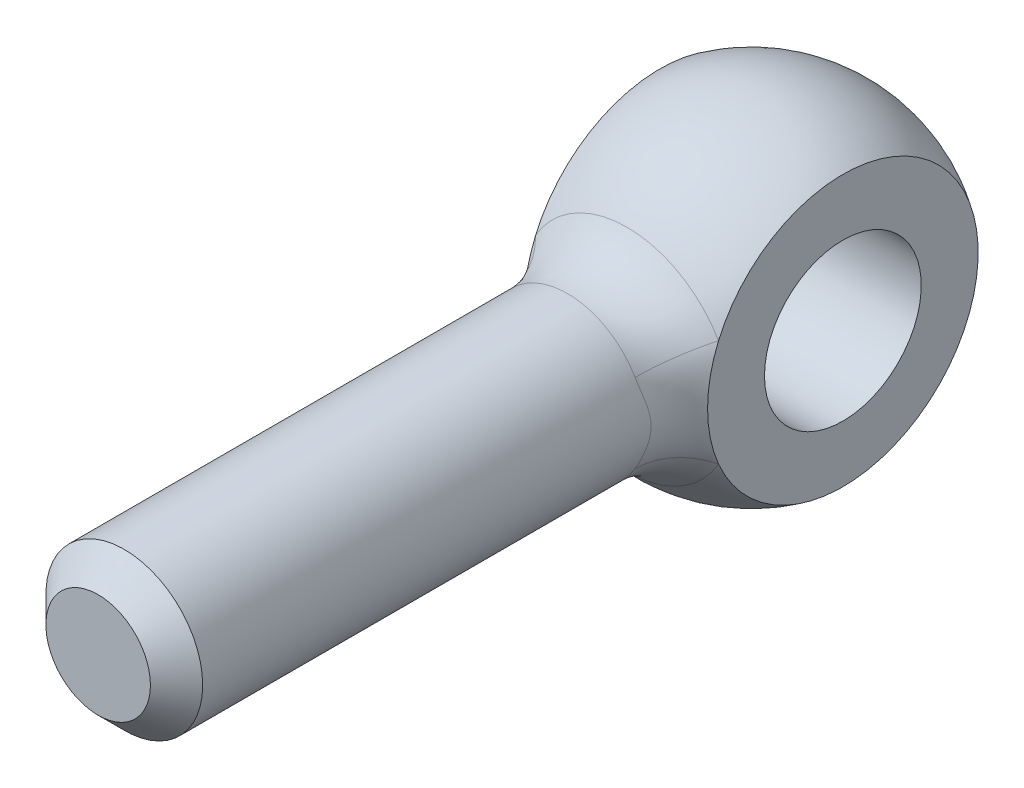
ISO-10303-21;
HEADER;
FILE_DESCRIPTION(('STEP AP214'),'2;1');
FILE_NAME('part.step','',(''),(''),'','','');
FILE_SCHEMA(('AUTOMOTIVE_DESIGN { 1 0 10303 214 1 1 1 1 }'));
ENDSEC;
DATA;
#1=APPLICATION_CONTEXT('core data for automotive mechanical design processes');
#2=APPLICATION_PROTOCOL_DEFINITION('international standard','automotive_design',2000,#1);
#3=PRODUCT_CONTEXT('',#1,'mechanical');
#4=PRODUCT('Part','Part','',(#3));
#5=PRODUCT_RELATED_PRODUCT_CATEGORY('part','',(#4));
#6=PRODUCT_DEFINITION_FORMATION('','',#4);
#7=PRODUCT_DEFINITION_CONTEXT('part definition',#1,'design');
#8=PRODUCT_DEFINITION('design','',#6,#7);
#9=PRODUCT_DEFINITION_SHAPE('','',#8);
#10=(LENGTH_UNIT() NAMED_UNIT(*) SI_UNIT(.MILLI.,.METRE.));
#11=(NAMED_UNIT(*) PLANE_ANGLE_UNIT() SI_UNIT($,.RADIAN.));
#12=(NAMED_UNIT(*) SI_UNIT($,.STERADIAN.) SOLID_ANGLE_UNIT());
#13=UNCERTAINTY_MEASURE_WITH_UNIT(LENGTH_MEASURE(1.E-05),#10,'distance_accuracy_value','');
#14=(GEOMETRIC_REPRESENTATION_CONTEXT(3) GLOBAL_UNCERTAINTY_ASSIGNED_CONTEXT((#13)) GLOBAL_UNIT_ASSIGNED_CONTEXT((#10,
#11,#12)) REPRESENTATION_CONTEXT('',''));
#15=CARTESIAN_POINT('',(0.,0.,0.));
#16=DIRECTION('',(0.,0.,1.));
#17=DIRECTION('',(1.,0.,0.));
#18=AXIS2_PLACEMENT_3D('',#15,#16,#17);
#19=CARTESIAN_POINT('',(0.,0.,0.));
#20=DIRECTION('',(-1.,0.,0.));
#21=DIRECTION('',(0.,0.,-1.));
#22=AXIS2_PLACEMENT_3D('',#19,#20,#21);
#23=SPHERICAL_SURFACE('',#22,12.5);
#24=CARTESIAN_POINT('',(7.,0.,0.));
#25=DIRECTION('',(1.,0.,0.));
#26=DIRECTION('',(0.,0.,1.));
#27=AXIS2_PLACEMENT_3D('',#24,#25,#26);
#28=CIRCLE('',#27,10.356157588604);
#29=CARTESIAN_POINT('',(7.,4.09162768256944,9.51359989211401));
#30=VERTEX_POINT('',#29);
#31=CARTESIAN_POINT('',(7.,-4.09162768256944,9.51359989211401));
#32=VERTEX_POINT('',#31);
#33=EDGE_CURVE('E64',#30,#32,#28,.F.);
#34=ORIENTED_EDGE('',*,*,#33,.T.);
#35=CARTESIAN_POINT('',(0.,0.,9.51359989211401));
#36=DIRECTION('',(0.,0.,-1.));
#37=DIRECTION('',(-1.,0.,0.));
#38=AXIS2_PLACEMENT_3D('',#35,#36,#37);
#39=CIRCLE('',#38,8.10810810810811);
#40=CARTESIAN_POINT('',(-7.,-4.09162768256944,9.51359989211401));
#41=VERTEX_POINT('',#40);
#42=EDGE_CURVE('E72',#32,#41,#39,.T.);
#43=ORIENTED_EDGE('',*,*,#42,.T.);
#44=CARTESIAN_POINT('',(-7.,0.,0.));
#45=DIRECTION('',(1.,0.,0.));
#46=DIRECTION('',(0.,0.,1.));
#47=AXIS2_PLACEMENT_3D('',#44,#45,#46);
#48=CIRCLE('',#47,10.356157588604);
#49=CARTESIAN_POINT('',(-7.,4.09162768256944,9.51359989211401));
#50=VERTEX_POINT('',#49);
#51=EDGE_CURVE('E60',#50,#41,#48,.F.);
#52=ORIENTED_EDGE('',*,*,#51,.F.);
#53=CARTESIAN_POINT('',(0.,0.,9.51359989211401));
#54=DIRECTION('',(0.,0.,-1.));
#55=DIRECTION('',(-1.,0.,0.));
#56=AXIS2_PLACEMENT_3D('',#53,#54,#55);
#57=CIRCLE('',#56,8.10810810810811);
#58=EDGE_CURVE('E69',#50,#30,#57,.T.);
#59=ORIENTED_EDGE('',*,*,#58,.T.);
#60=EDGE_LOOP('',(#34,#43,#52,#59));
#61=FACE_BOUND('',#60,.T.);
#62=ADVANCED_FACE('F14',(#61),#23,.T.);
#63=CARTESIAN_POINT('',(0.,0.,-10.));
#64=DIRECTION('',(0.,0.,-1.));
#65=DIRECTION('',(1.,0.,0.));
#66=AXIS2_PLACEMENT_3D('',#63,#64,#65);
#67=CYLINDRICAL_SURFACE('',#66,6.);
#68=CARTESIAN_POINT('',(7.,5.52065398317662,8.76198491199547));
#69=CARTESIAN_POINT('',(4.73347627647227,3.77093452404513,10.4723797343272));
#70=CARTESIAN_POINT('',(4.16393928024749,4.31990852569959,13.7124960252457));
#71=CARTESIAN_POINT('',(7.,5.43196770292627,8.81784504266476));
#72=CARTESIAN_POINT('',(4.75237008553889,3.73175735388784,10.5424849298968));
#73=CARTESIAN_POINT('',(4.24629318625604,4.24055975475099,13.7683625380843));
#74=CARTESIAN_POINT('',(7.,5.34113250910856,8.87321411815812));
#75=CARTESIAN_POINT('',(4.774361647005,3.69082707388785,10.6107881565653));
#76=CARTESIAN_POINT('',(4.32694937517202,4.15824402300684,13.8171854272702));
#77=CARTESIAN_POINT('',(7.,5.15454022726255,8.98290118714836));
#78=CARTESIAN_POINT('',(4.82415359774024,3.60403478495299,10.743005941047));
#79=CARTESIAN_POINT('',(4.48416075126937,3.98818699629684,13.9015926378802));
#80=CARTESIAN_POINT('',(7.,5.05878355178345,9.03721926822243));
#81=CARTESIAN_POINT('',(4.85191265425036,3.55821882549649,10.8069099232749));
#82=CARTESIAN_POINT('',(4.56071628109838,3.90044615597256,13.9371780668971));
#83=CARTESIAN_POINT('',(7.,4.86225075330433,9.14444949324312));
#84=CARTESIAN_POINT('',(4.91269251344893,3.46043710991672,10.9295511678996));
#85=CARTESIAN_POINT('',(4.70862752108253,3.72052921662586,13.9958066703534));
#86=CARTESIAN_POINT('',(7.,4.76150508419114,9.19736772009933));
#87=CARTESIAN_POINT('',(4.94564175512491,3.40856162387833,10.988313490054));
#88=CARTESIAN_POINT('',(4.78000947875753,3.62838012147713,14.0189176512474));
#89=CARTESIAN_POINT('',(7.,4.55392848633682,9.30189435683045));
#90=CARTESIAN_POINT('',(5.01603086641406,3.29716736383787,11.1005263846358));
#91=CARTESIAN_POINT('',(4.91748494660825,3.4397597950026,14.0539297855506));
#92=CARTESIAN_POINT('',(7.,4.44710008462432,9.35350329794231));
#93=CARTESIAN_POINT('',(5.05343304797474,3.23771146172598,11.1539919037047));
#94=CARTESIAN_POINT('',(4.98358062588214,3.3432903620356,14.0658355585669));
#95=CARTESIAN_POINT('',(7.,4.2969586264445,9.42274283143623));
#96=CARTESIAN_POINT('',(5.10676472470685,3.15059746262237,11.2230561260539));
#97=CARTESIAN_POINT('',(5.06977684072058,3.20923152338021,14.0752452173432));
#98=CARTESIAN_POINT('',(7.,4.25653508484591,9.44107582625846));
#99=CARTESIAN_POINT('',(5.12115703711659,3.12687435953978,11.2410365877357));
#100=CARTESIAN_POINT('',(5.09235610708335,3.17328084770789,14.0770920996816));
#101=CARTESIAN_POINT('',(7.,4.17477524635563,9.4775130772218));
#102=CARTESIAN_POINT('',(5.15031007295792,3.07824781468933,11.2762248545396));
#103=CARTESIAN_POINT('',(5.13675282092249,3.10089882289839,14.0795339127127));
#104=CARTESIAN_POINT('',(7.,4.13343888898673,9.4956173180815));
#105=CARTESIAN_POINT('',(5.16506981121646,3.05334717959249,11.2934339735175));
#106=CARTESIAN_POINT('',(5.15857021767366,3.06446744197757,14.0801287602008));
#107=CARTESIAN_POINT('',(7.,3.93727090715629,9.57998716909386));
#108=CARTESIAN_POINT('',(5.23484389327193,2.93397708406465,11.3720989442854));
#109=CARTESIAN_POINT('',(5.25911352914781,2.89245379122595,14.0801244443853));
#110=CARTESIAN_POINT('',(7.,3.77644238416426,9.64471624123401));
#111=CARTESIAN_POINT('',(5.29198516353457,2.8314905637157,11.4288485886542));
#112=CARTESIAN_POINT('',(5.33294423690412,2.75394693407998,14.0720012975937));
#113=CARTESIAN_POINT('',(7.,3.44057965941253,9.7695721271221));
#114=CARTESIAN_POINT('',(5.40674389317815,2.60847852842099,11.5309624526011));
#115=CARTESIAN_POINT('',(5.46944812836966,2.47178930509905,14.0431824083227));
#116=CARTESIAN_POINT('',(7.,3.26553398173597,9.82969514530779));
#117=CARTESIAN_POINT('',(5.46437197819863,2.48805001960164,11.5764173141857));
#118=CARTESIAN_POINT('',(5.53211216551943,2.3281344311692,14.0224764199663));
#119=CARTESIAN_POINT('',(7.,2.89956860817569,9.94381011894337));
#120=CARTESIAN_POINT('',(5.57626625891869,2.2285734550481,11.6561394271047));
#121=CARTESIAN_POINT('',(5.64613166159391,2.03613701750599,13.9728223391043));
#122=CARTESIAN_POINT('',(7.,2.70859175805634,9.99777819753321));
#123=CARTESIAN_POINT('',(5.63058064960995,2.08950571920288,11.6904716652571));
#124=CARTESIAN_POINT('',(5.69744376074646,1.88777889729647,13.9438435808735));
#125=CARTESIAN_POINT('',(7.,2.31090588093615,10.0971127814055));
#126=CARTESIAN_POINT('',(5.73158522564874,1.79407236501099,11.7485069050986));
#127=CARTESIAN_POINT('',(5.78825827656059,1.58765614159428,13.8830399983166));
#128=CARTESIAN_POINT('',(7.,2.10419766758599,10.1424797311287));
#129=CARTESIAN_POINT('',(5.77837504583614,1.6376681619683,11.7723070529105));
#130=CARTESIAN_POINT('',(5.82776130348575,1.43589168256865,13.8512153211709));
#131=CARTESIAN_POINT('',(7.,1.67085359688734,10.2229078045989));
#132=CARTESIAN_POINT('',(5.86150775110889,1.30600608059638,11.8111628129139));
#133=CARTESIAN_POINT('',(5.8955793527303,1.12600155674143,13.7902383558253));
#134=CARTESIAN_POINT('',(7.,1.44386630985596,10.2577049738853));
#135=CARTESIAN_POINT('',(5.8977103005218,1.13021047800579,11.8260828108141));
#136=CARTESIAN_POINT('',(5.92361308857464,0.967810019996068,13.7611653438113));
#137=CARTESIAN_POINT('',(7.,0.977611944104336,10.312575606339));
#138=CARTESIAN_POINT('',(5.95469562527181,0.767202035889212,11.8481867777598));
#139=CARTESIAN_POINT('',(5.96692621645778,0.649309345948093,13.7134560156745));
#140=CARTESIAN_POINT('',(7.,0.738348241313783,10.3326530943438));
#141=CARTESIAN_POINT('',(5.97558995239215,0.579692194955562,11.855420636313));
#142=CARTESIAN_POINT('',(5.98220909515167,0.489000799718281,13.6948168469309));
#143=CARTESIAN_POINT('',(7.,0.254575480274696,10.3558486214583));
#144=CARTESIAN_POINT('',(5.99967335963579,0.200191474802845,11.8636655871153));
#145=CARTESIAN_POINT('',(5.99980579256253,0.167748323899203,13.673156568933));
#146=CARTESIAN_POINT('',(7.,0.0100795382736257,10.3590049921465));
#147=CARTESIAN_POINT('',(6.0029543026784,0.00781202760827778,11.864708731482));
#148=CARTESIAN_POINT('',(6.00214892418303,0.00680665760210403,13.670100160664));
#149=CARTESIAN_POINT('',(7.,-0.476166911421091,10.3480653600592));
#150=CARTESIAN_POINT('',(5.99159819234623,-0.374022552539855,11.8609024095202));
#151=CARTESIAN_POINT('',(5.9939026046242,-0.314617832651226,13.6804268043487));
#152=CARTESIAN_POINT('',(7.,-0.717917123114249,10.3339675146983));
#153=CARTESIAN_POINT('',(5.97693421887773,-0.563895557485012,11.8560440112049));
#154=CARTESIAN_POINT('',(5.98331177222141,-0.475100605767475,13.6938116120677));
#155=CARTESIAN_POINT('',(7.,-1.17711086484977,10.2914790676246));
#156=CARTESIAN_POINT('',(5.93280719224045,-0.922682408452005,11.839841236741));
#157=CARTESIAN_POINT('',(5.95036755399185,-0.784814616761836,13.7319958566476));
#158=CARTESIAN_POINT('',(7.,-1.39514583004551,10.2639850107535));
#159=CARTESIAN_POINT('',(5.90419169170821,-1.09249310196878,11.8288660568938));
#160=CARTESIAN_POINT('',(5.92874844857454,-0.934149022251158,13.7560718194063));
#161=CARTESIAN_POINT('',(7.,-1.81839648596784,10.1975189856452));
#162=CARTESIAN_POINT('',(5.83527764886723,-1.41926666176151,11.7992510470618));
#163=CARTESIAN_POINT('',(5.87439634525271,-1.23051561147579,13.809953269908));
#164=CARTESIAN_POINT('',(7.,-2.02361108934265,10.1585460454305));
#165=CARTESIAN_POINT('',(5.79487748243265,-1.57641328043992,11.7805559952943));
#166=CARTESIAN_POINT('',(5.84166240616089,-1.37754759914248,13.8397592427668));
#167=CARTESIAN_POINT('',(7.,-2.41979553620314,10.0715339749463));
#168=CARTESIAN_POINT('',(5.70553324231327,-1.87549175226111,11.7340817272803));
#169=CARTESIAN_POINT('',(5.76521762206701,-1.66881679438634,13.8994060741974));
#170=CARTESIAN_POINT('',(7.,-2.61075717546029,10.0234896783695));
#171=CARTESIAN_POINT('',(5.65648641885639,-2.01749587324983,11.7062202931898));
#172=CARTESIAN_POINT('',(5.72150051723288,-1.81305235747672,13.9292469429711));
#173=CARTESIAN_POINT('',(7.,-2.97823759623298,9.92051035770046));
#174=CARTESIAN_POINT('',(5.55330052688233,-2.28497381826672,11.6404397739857));
#175=CARTESIAN_POINT('',(5.6232485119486,-2.09804332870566,13.9837841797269));
#176=CARTESIAN_POINT('',(7.,-3.15475790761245,9.86557606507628));
#177=CARTESIAN_POINT('',(5.49908883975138,-2.41044201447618,11.6024299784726));
#178=CARTESIAN_POINT('',(5.56871475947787,-2.2387991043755,14.0084810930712));
#179=CARTESIAN_POINT('',(7.,-3.47765739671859,9.7561304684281));
#180=CARTESIAN_POINT('',(5.39445517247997,-2.63320590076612,11.5201628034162));
#181=CARTESIAN_POINT('',(5.45483407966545,-2.50267587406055,14.0464316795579));
#182=CARTESIAN_POINT('',(7.,-3.62530052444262,9.70209213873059));
#183=CARTESIAN_POINT('',(5.34411434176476,-2.73206566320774,11.4767663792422));
#184=CARTESIAN_POINT('',(5.39646281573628,-2.62618577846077,14.0605611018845));
#185=CARTESIAN_POINT('',(7.,-3.9101338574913,9.59083995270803));
#186=CARTESIAN_POINT('',(5.2447017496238,-2.9165097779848,11.3815427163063));
#187=CARTESIAN_POINT('',(5.27135185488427,-2.86906036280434,14.0783371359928));
#188=CARTESIAN_POINT('',(7.,-4.04732718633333,9.53362705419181));
#189=CARTESIAN_POINT('',(5.19563379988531,-3.00201545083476,11.3296558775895));
#190=CARTESIAN_POINT('',(5.2046146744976,-2.98842627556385,14.0819868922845));
#191=CARTESIAN_POINT('',(7.,-4.31290967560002,9.41647692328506));
#192=CARTESIAN_POINT('',(5.10089049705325,-3.16117080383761,11.2175543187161));
#193=CARTESIAN_POINT('',(5.0627722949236,-3.22291536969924,14.0764425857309));
#194=CARTESIAN_POINT('',(7.,-4.44124691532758,9.35652657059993));
#195=CARTESIAN_POINT('',(5.05526955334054,-3.23465246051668,11.1572503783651));
#196=CARTESIAN_POINT('',(4.98762357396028,-3.33801195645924,14.0671785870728));
#197=CARTESIAN_POINT('',(7.,-4.68940217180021,9.23463387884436));
#198=CARTESIAN_POINT('',(4.96955301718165,-3.37092279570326,11.0291198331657));
#199=CARTESIAN_POINT('',(4.82981665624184,-3.56255813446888,14.0336945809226));
#200=CARTESIAN_POINT('',(7.,-4.80920993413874,9.17268926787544));
#201=CARTESIAN_POINT('',(4.92951762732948,-3.43360058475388,10.9612577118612));
#202=CARTESIAN_POINT('',(4.74714968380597,-3.67200088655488,14.0094568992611));
#203=CARTESIAN_POINT('',(7.,-4.92515727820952,9.11003983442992));
#204=CARTESIAN_POINT('',(4.89339612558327,-3.49152887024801,10.8902848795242));
#205=CARTESIAN_POINT('',(4.66109414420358,-3.77812140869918,13.9767461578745));
#206=(BOUNDED_SURFACE() B_SPLINE_SURFACE(3,2,((#68,#69,#70),(#71,#72,#73),(#74,#75,#76),(#77,
#78,#79),(#80,#81,#82),(#83,#84,#85),(#86,#87,#88),(#89,#90,#91),(#92,#93,#94),(#95,#96,#97),
(#98,#99,#100),(#101,#102,#103),(#104,#105,#106),(#107,#108,#109),(#110,#111,#112),(#113,#114,
#115),(#116,#117,#118),(#119,#120,#121),(#122,#123,#124),(#125,#126,#127),(#128,#129,#130),
(#131,#132,#133),(#134,#135,#136),(#137,#138,#139),(#140,#141,#142),(#143,#144,#145),(#146,#147,
#148),(#149,#150,#151),(#152,#153,#154),(#155,#156,#157),(#158,#159,#160),(#161,#162,#163),
(#164,#165,#166),(#167,#168,#169),(#170,#171,#172),(#173,#174,#175),(#176,#177,#178),(#179,#180,
#181),(#182,#183,#184),(#185,#186,#187),(#188,#189,#190),(#191,#192,#193),(#194,#195,#196),
(#197,#198,#199),(#200,#201,#202),(#203,#204,#205)),.UNSPECIFIED.,.F.,.F.,
.F.) B_SPLINE_SURFACE_WITH_KNOTS((4,2,2,2,2,2,2,2,2,2,2,2,2,2,2,2,2,2,2,2,2,2,4),(3,3),(0.,
0.706069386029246,1.41207968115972,2.11421270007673,2.8160561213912,3.07081429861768,
3.32558940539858,4.26615695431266,5.20749141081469,6.15236157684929,7.09718290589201,
8.06395765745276,9.03046796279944,9.99478789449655,10.9592108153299,11.8664791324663,
12.7738242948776,13.6816877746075,14.5894549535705,15.4094238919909,16.2291467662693,
17.0533262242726,17.8784803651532),(0.,1.),
.UNSPECIFIED.) GEOMETRIC_REPRESENTATION_ITEM() RATIONAL_B_SPLINE_SURFACE(((1.,0.874036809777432,
1.),(1.,0.875980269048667,1.),(1.,0.878049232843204,1.),(1.,0.882404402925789,1.),(1.,
0.884690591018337,1.),(1.,0.889433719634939,1.),(1.,0.891889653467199,1.),(1.,0.896934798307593,
1.),(1.,0.899523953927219,1.),(1.,0.903105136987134,1.),(1.,0.904063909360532,1.),(1.,
0.905988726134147,1.),(1.,0.906954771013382,1.),(1.,0.911497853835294,1.),(1.,0.915103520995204,
1.),(1.,0.922211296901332,1.),(1.,0.925713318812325,1.),(1.,0.932445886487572,1.),(1.,
0.935675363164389,1.),(1.,0.941657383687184,1.),(1.,0.944409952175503,1.),(1.,0.94930028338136,
1.),(1.,0.951422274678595,1.),(1.,0.95476877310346,1.),(1.,0.955993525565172,1.),(1.,
0.957408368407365,1.),(1.,0.957600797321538,1.),(1.,0.956933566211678,1.),(1.,0.956073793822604,
1.),(1.,0.953481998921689,1.),(1.,0.951804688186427,1.),(1.,0.947755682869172,1.),(1.,
0.94538392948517,1.),(1.,0.940114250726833,1.),(1.,0.937216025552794,1.),(1.,0.931066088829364,
1.),(1.,0.927814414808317,1.),(1.,0.921446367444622,1.),(1.,0.918347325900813,1.),(1.,
0.912110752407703,1.),(1.,0.908973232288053,1.),(1.,0.902748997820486,1.),(1.,0.899662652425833,
1.),(1.,0.893647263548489,1.),(1.,0.890718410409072,1.),(1.,0.887916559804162,1.))) REPRESENTATION_ITEM('') SURFACE());
#207=CARTESIAN_POINT('',(4.66109414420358,-3.77812140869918,13.9767461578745));
#208=CARTESIAN_POINT('',(4.74714968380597,-3.67200088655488,14.0094568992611));
#209=CARTESIAN_POINT('',(4.82981665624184,-3.56255813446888,14.0336945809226));
#210=CARTESIAN_POINT('',(4.98762357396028,-3.33801195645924,14.0671785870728));
#211=CARTESIAN_POINT('',(5.0627722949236,-3.22291536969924,14.0764425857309));
#212=CARTESIAN_POINT('',(5.2046146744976,-2.98842627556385,14.0819868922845));
#213=CARTESIAN_POINT('',(5.27135185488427,-2.86906036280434,14.0783371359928));
#214=CARTESIAN_POINT('',(5.39646281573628,-2.62618577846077,14.0605611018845));
#215=CARTESIAN_POINT('',(5.45483407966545,-2.50267587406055,14.0464316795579));
#216=CARTESIAN_POINT('',(5.56871475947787,-2.2387991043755,14.0084810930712));
#217=CARTESIAN_POINT('',(5.6232485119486,-2.09804332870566,13.9837841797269));
#218=CARTESIAN_POINT('',(5.72150051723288,-1.81305235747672,13.9292469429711));
#219=CARTESIAN_POINT('',(5.76521762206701,-1.66881679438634,13.8994060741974));
#220=CARTESIAN_POINT('',(5.84166240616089,-1.37754759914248,13.8397592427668));
#221=CARTESIAN_POINT('',(5.87439634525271,-1.23051561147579,13.809953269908));
#222=CARTESIAN_POINT('',(5.92874844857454,-0.934149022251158,13.7560718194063));
#223=CARTESIAN_POINT('',(5.95036755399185,-0.784814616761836,13.7319958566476));
#224=CARTESIAN_POINT('',(5.98331177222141,-0.475100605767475,13.6938116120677));
#225=CARTESIAN_POINT('',(5.9939026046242,-0.314617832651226,13.6804268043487));
#226=CARTESIAN_POINT('',(6.00214892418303,0.00680665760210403,13.670100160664));
#227=CARTESIAN_POINT('',(5.99980579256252,0.167748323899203,13.673156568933));
#228=CARTESIAN_POINT('',(5.98220909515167,0.489000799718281,13.6948168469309));
#229=CARTESIAN_POINT('',(5.96692621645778,0.649309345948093,13.7134560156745));
#230=CARTESIAN_POINT('',(5.92361308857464,0.967810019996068,13.7611653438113));
#231=CARTESIAN_POINT('',(5.8955793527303,1.12600155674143,13.7902383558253));
#232=CARTESIAN_POINT('',(5.82776130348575,1.43589168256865,13.8512153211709));
#233=CARTESIAN_POINT('',(5.78825827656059,1.58765614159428,13.8830399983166));
#234=CARTESIAN_POINT('',(5.69744376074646,1.88777889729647,13.9438435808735));
#235=CARTESIAN_POINT('',(5.64613166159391,2.03613701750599,13.9728223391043));
#236=CARTESIAN_POINT('',(5.53211216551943,2.3281344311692,14.0224764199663));
#237=CARTESIAN_POINT('',(5.46944812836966,2.47178930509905,14.0431824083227));
#238=CARTESIAN_POINT('',(5.33294423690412,2.75394693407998,14.0720012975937));
#239=CARTESIAN_POINT('',(5.2591135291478,2.89245379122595,14.0801244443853));
#240=CARTESIAN_POINT('',(5.15857021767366,3.06446744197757,14.0801287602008));
#241=CARTESIAN_POINT('',(5.13675282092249,3.10089882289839,14.0795339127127));
#242=CARTESIAN_POINT('',(5.09235610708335,3.17328084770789,14.0770920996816));
#243=CARTESIAN_POINT('',(5.06977684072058,3.20923152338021,14.0752452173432));
#244=CARTESIAN_POINT('',(4.98358062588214,3.3432903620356,14.0658355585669));
#245=CARTESIAN_POINT('',(4.91748494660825,3.4397597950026,14.0539297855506));
#246=CARTESIAN_POINT('',(4.78000947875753,3.62838012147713,14.0189176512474));
#247=CARTESIAN_POINT('',(4.70862752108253,3.72052921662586,13.9958066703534));
#248=CARTESIAN_POINT('',(4.56071628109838,3.90044615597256,13.9371780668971));
#249=CARTESIAN_POINT('',(4.48416075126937,3.98818699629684,13.9015926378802));
#250=CARTESIAN_POINT('',(4.32694937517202,4.15824402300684,13.8171854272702));
#251=CARTESIAN_POINT('',(4.24629318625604,4.24055975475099,13.7683625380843));
#252=CARTESIAN_POINT('',(4.16393928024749,4.31990852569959,13.7124960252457));
#253=B_SPLINE_CURVE_WITH_KNOTS('',3,(#207,#208,#209,#210,#211,#212,#213,#214,#215,#216,#217,
#218,#219,#220,#221,#222,#223,#224,#225,#226,#227,#228,#229,#230,#231,#232,#233,#234,#235,#236,
#237,#238,#239,#240,#241,#242,#243,#244,#245,#246,#247,#248,#249,#250,#251,#252),.UNSPECIFIED.,
.F.,.F.,(4,2,2,2,2,2,2,2,2,2,2,2,2,2,2,2,2,2,2,2,2,2,4),(0.,0.825154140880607,1.64933359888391,
2.46905647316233,3.28902541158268,4.19679259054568,5.10465607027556,6.01200123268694,
6.91926954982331,7.88369247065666,8.84801240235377,9.81452270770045,10.7812974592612,
11.7261187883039,12.6709889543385,13.6123234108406,14.5528909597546,14.8076660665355,
15.062424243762,15.7642676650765,16.4664006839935,17.172410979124,17.8784803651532),.UNSPECIFIED.);
#254=CARTESIAN_POINT('',(5.18,-3.02780448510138,14.0801278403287));
#255=VERTEX_POINT('',#254);
#256=CARTESIAN_POINT('',(5.18,3.02780448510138,14.0801278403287));
#257=VERTEX_POINT('',#256);
#258=EDGE_CURVE('E87',#255,#257,#253,.T.);
#259=ORIENTED_EDGE('',*,*,#258,.T.);
#260=CARTESIAN_POINT('',(0.,0.,14.0801278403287));
#261=DIRECTION('',(0.,0.,-1.));
#262=DIRECTION('',(-1.,0.,0.));
#263=AXIS2_PLACEMENT_3D('',#260,#261,#262);
#264=CIRCLE('',#263,6.);
#265=CARTESIAN_POINT('',(-5.18,3.02780448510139,14.0801278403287));
#266=VERTEX_POINT('',#265);
#267=EDGE_CURVE('E9',#257,#266,#264,.F.);
#268=ORIENTED_EDGE('',*,*,#267,.T.);
#269=CARTESIAN_POINT('',(-7.,-5.52065404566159,8.76198487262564));
#270=CARTESIAN_POINT('',(-4.73347625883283,-3.77093454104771,10.4723796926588));
#271=CARTESIAN_POINT('',(-4.16393928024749,-4.31990852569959,13.7124960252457));
#272=CARTESIAN_POINT('',(-7.,-5.43196772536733,8.81784502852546));
#273=CARTESIAN_POINT('',(-4.7523700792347,-3.73175735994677,10.5424849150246));
#274=CARTESIAN_POINT('',(-4.24629318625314,-4.24055975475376,13.7683625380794));
#275=CARTESIAN_POINT('',(-7.,-5.34113251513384,8.87321411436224));
#276=CARTESIAN_POINT('',(-4.77436164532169,-3.69082707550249,10.610788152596));
#277=CARTESIAN_POINT('',(-4.3269493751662,-4.15824402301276,13.8171854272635));
#278=CARTESIAN_POINT('',(-7.,-5.15454022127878,8.98290119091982));
#279=CARTESIAN_POINT('',(-4.82415359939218,-3.60403478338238,10.7430059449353));
#280=CARTESIAN_POINT('',(-4.48416075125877,-3.98818699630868,13.9015926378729));
#281=CARTESIAN_POINT('',(-7.,-5.05878355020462,9.03721926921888));
#282=CARTESIAN_POINT('',(-4.85191265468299,-3.55821882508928,10.8069099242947));
#283=CARTESIAN_POINT('',(-4.56071628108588,-3.90044615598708,13.937178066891));
#284=CARTESIAN_POINT('',(-7.,-4.86225075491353,9.14444949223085));
#285=CARTESIAN_POINT('',(-4.91269251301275,-3.46043711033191,10.9295511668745));
#286=CARTESIAN_POINT('',(-4.70862752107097,-3.7205292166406,13.9958066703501));
#287=CARTESIAN_POINT('',(-7.,-4.76150508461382,9.19736771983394));
#288=CARTESIAN_POINT('',(-4.94564175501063,-3.40856162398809,10.9883134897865));
#289=CARTESIAN_POINT('',(-4.78000947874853,-3.62838012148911,14.018917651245));
#290=CARTESIAN_POINT('',(-7.,-4.55392848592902,9.30189435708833));
#291=CARTESIAN_POINT('',(-5.0160308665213,-3.29716736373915,11.1005263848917));
#292=CARTESIAN_POINT('',(-4.91748494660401,-3.43975979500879,14.0539297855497));
#293=CARTESIAN_POINT('',(-7.,-4.44710008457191,9.35350329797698));
#294=CARTESIAN_POINT('',(-5.0534330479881,-3.23771146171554,11.1539919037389));
#295=CARTESIAN_POINT('',(-4.9835806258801,-3.34329036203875,14.0658355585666));
#296=CARTESIAN_POINT('',(-7.,-4.29695862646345,9.42274283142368));
#297=CARTESIAN_POINT('',(-5.10676472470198,-3.15059746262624,11.2230561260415));
#298=CARTESIAN_POINT('',(-5.06977684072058,-3.20923152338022,14.0752452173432));
#299=CARTESIAN_POINT('',(-7.,-4.25653508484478,9.44107582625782));
#300=CARTESIAN_POINT('',(-5.12115703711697,-3.12687435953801,11.241036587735));
#301=CARTESIAN_POINT('',(-5.09235610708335,-3.1732808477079,14.0770920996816));
#302=CARTESIAN_POINT('',(-7.,-4.17477524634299,9.47751307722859));
#303=CARTESIAN_POINT('',(-5.15031007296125,-3.07824781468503,11.2762248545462));
#304=CARTESIAN_POINT('',(-5.13675282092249,-3.1008988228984,14.0795339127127));
#305=CARTESIAN_POINT('',(-7.,-4.13343888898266,9.49561731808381));
#306=CARTESIAN_POINT('',(-5.16506981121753,-3.05334717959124,11.2934339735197));
#307=CARTESIAN_POINT('',(-5.15857021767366,-3.06446744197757,14.0801287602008));
#308=CARTESIAN_POINT('',(-7.,-3.93727090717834,9.57998716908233));
#309=CARTESIAN_POINT('',(-5.2348438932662,-2.93397708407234,11.3720989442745));
#310=CARTESIAN_POINT('',(-5.2591135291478,-2.89245379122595,14.0801244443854));
#311=CARTESIAN_POINT('',(-7.,-3.77644238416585,9.64471624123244));
#312=CARTESIAN_POINT('',(-5.29198516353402,-2.83149056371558,11.4288485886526));
#313=CARTESIAN_POINT('',(-5.33294423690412,-2.75394693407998,14.0720012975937));
#314=CARTESIAN_POINT('',(-7.,-3.44057965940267,9.76957212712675));
#315=CARTESIAN_POINT('',(-5.4067438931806,-2.60847852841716,11.5309624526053));
#316=CARTESIAN_POINT('',(-5.46944812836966,-2.47178930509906,14.0431824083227));
#317=CARTESIAN_POINT('',(-7.,-3.26553398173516,9.82969514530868));
#318=CARTESIAN_POINT('',(-5.46437197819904,-2.48805001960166,11.5764173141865));
#319=CARTESIAN_POINT('',(-5.53211216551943,-2.32813443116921,14.0224764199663));
#320=CARTESIAN_POINT('',(-7.,-2.89956860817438,9.94381011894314));
#321=CARTESIAN_POINT('',(-5.5762662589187,-2.228573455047,11.6561394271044));
#322=CARTESIAN_POINT('',(-5.64613166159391,-2.036137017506,13.9728223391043));
#323=CARTESIAN_POINT('',(-7.,-2.70859175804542,9.99777819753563));
#324=CARTESIAN_POINT('',(-5.63058064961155,-2.08950571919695,11.690471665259));
#325=CARTESIAN_POINT('',(-5.69744376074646,-1.88777889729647,13.9438435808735));
#326=CARTESIAN_POINT('',(-7.,-2.31090588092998,10.0971127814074));
#327=CARTESIAN_POINT('',(-5.73158522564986,-1.79407236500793,11.7485069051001));
#328=CARTESIAN_POINT('',(-5.78825827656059,-1.58765614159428,13.8830399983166));
#329=CARTESIAN_POINT('',(-7.,-2.10419766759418,10.1424797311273));
#330=CARTESIAN_POINT('',(-5.77837504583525,-1.63766816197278,11.7723070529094));
#331=CARTESIAN_POINT('',(-5.82776130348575,-1.43589168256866,13.8512153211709));
#332=CARTESIAN_POINT('',(-7.,-1.67085359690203,10.222907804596));
#333=CARTESIAN_POINT('',(-5.86150775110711,-1.30600608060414,11.8111628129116));
#334=CARTESIAN_POINT('',(-5.8955793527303,-1.12600155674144,13.7902383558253));
#335=CARTESIAN_POINT('',(-7.,-1.44386630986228,10.2577049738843));
#336=CARTESIAN_POINT('',(-5.89771030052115,-1.13021047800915,11.8260828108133));
#337=CARTESIAN_POINT('',(-5.92361308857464,-0.967810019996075,13.7611653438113));
#338=CARTESIAN_POINT('',(-7.,-0.977611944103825,10.3125756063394));
#339=CARTESIAN_POINT('',(-5.95469562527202,-0.767202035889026,11.8481867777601));
#340=CARTESIAN_POINT('',(-5.96692621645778,-0.649309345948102,13.7134560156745));
#341=CARTESIAN_POINT('',(-7.,-0.738348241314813,10.3326530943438));
#342=CARTESIAN_POINT('',(-5.9755899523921,-0.579692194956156,11.855420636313));
#343=CARTESIAN_POINT('',(-5.98220909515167,-0.489000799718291,13.6948168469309));
#344=CARTESIAN_POINT('',(-7.,-0.254575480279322,10.3558486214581));
#345=CARTESIAN_POINT('',(-5.99967335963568,-0.200191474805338,11.8636655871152));
#346=CARTESIAN_POINT('',(-5.99980579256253,-0.167748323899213,13.673156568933));
#347=CARTESIAN_POINT('',(-7.,-0.0100795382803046,10.3590049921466));
#348=CARTESIAN_POINT('',(-6.00295430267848,-0.00781202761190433,11.8647087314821));
#349=CARTESIAN_POINT('',(-6.00214892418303,-0.0068066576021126,13.670100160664));
#350=CARTESIAN_POINT('',(-7.,0.476166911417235,10.3480653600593));
#351=CARTESIAN_POINT('',(-5.99159819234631,0.374022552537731,11.8609024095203));
#352=CARTESIAN_POINT('',(-5.9939026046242,0.314617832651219,13.6804268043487));
#353=CARTESIAN_POINT('',(-7.,0.717917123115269,10.3339675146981));
#354=CARTESIAN_POINT('',(-5.97693421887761,0.563895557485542,11.8560440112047));
#355=CARTESIAN_POINT('',(-5.98331177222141,0.475100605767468,13.6938116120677));
#356=CARTESIAN_POINT('',(-7.,1.17711086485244,10.2914790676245));
#357=CARTESIAN_POINT('',(-5.93280719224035,0.922682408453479,11.8398412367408));
#358=CARTESIAN_POINT('',(-5.95036755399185,0.784814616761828,13.7319958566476));
#359=CARTESIAN_POINT('',(-7.,1.39514583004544,10.2639850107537));
#360=CARTESIAN_POINT('',(-5.90419169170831,1.09249310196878,11.8288660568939));
#361=CARTESIAN_POINT('',(-5.92874844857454,0.934149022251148,13.7560718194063));
#362=CARTESIAN_POINT('',(-7.,1.8183964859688,10.1975189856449));
#363=CARTESIAN_POINT('',(-5.83527764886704,1.41926666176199,11.7992510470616));
#364=CARTESIAN_POINT('',(-5.87439634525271,1.23051561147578,13.809953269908));
#365=CARTESIAN_POINT('',(-7.,2.02361108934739,10.1585460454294));
#366=CARTESIAN_POINT('',(-5.79487748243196,1.5764132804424,11.7805559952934));
#367=CARTESIAN_POINT('',(-5.84166240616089,1.37754759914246,13.8397592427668));
#368=CARTESIAN_POINT('',(-7.,2.4197955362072,10.0715339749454));
#369=CARTESIAN_POINT('',(-5.70553324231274,1.8754917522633,11.7340817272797));
#370=CARTESIAN_POINT('',(-5.76521762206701,1.66881679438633,13.8994060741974));
#371=CARTESIAN_POINT('',(-7.,2.61075717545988,10.0234896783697));
#372=CARTESIAN_POINT('',(-5.65648641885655,2.01749587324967,11.70622029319));
#373=CARTESIAN_POINT('',(-5.72150051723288,1.81305235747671,13.9292469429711));
#374=CARTESIAN_POINT('',(-7.,2.97823759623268,9.9205103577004));
#375=CARTESIAN_POINT('',(-5.5533005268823,2.28497381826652,11.6404397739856));
#376=CARTESIAN_POINT('',(-5.6232485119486,2.09804332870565,13.9837841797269));
#377=CARTESIAN_POINT('',(-7.,3.15475790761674,9.86557606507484));
#378=CARTESIAN_POINT('',(-5.49908883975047,2.41044201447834,11.6024299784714));
#379=CARTESIAN_POINT('',(-5.56871475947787,2.23879910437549,14.0084810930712));
#380=CARTESIAN_POINT('',(-7.,3.47765739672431,9.75613046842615));
#381=CARTESIAN_POINT('',(-5.39445517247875,2.63320590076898,11.5201628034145));
#382=CARTESIAN_POINT('',(-5.45483407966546,2.50267587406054,14.0464316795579));
#383=CARTESIAN_POINT('',(-7.,3.62530052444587,9.70209213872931));
#384=CARTESIAN_POINT('',(-5.34411434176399,2.73206566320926,11.4767663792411));
#385=CARTESIAN_POINT('',(-5.39646281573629,2.62618577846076,14.0605611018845));
#386=CARTESIAN_POINT('',(-7.,3.91013385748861,9.59083995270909));
#387=CARTESIAN_POINT('',(-5.24470174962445,2.91650977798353,11.3815427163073));
#388=CARTESIAN_POINT('',(-5.27135185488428,2.86906036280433,14.0783371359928));
#389=CARTESIAN_POINT('',(-7.,4.04732718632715,9.53362705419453));
#390=CARTESIAN_POINT('',(-5.19563379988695,3.00201545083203,11.329655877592));
#391=CARTESIAN_POINT('',(-5.20461467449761,2.98842627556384,14.0819868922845));
#392=CARTESIAN_POINT('',(-7.,4.31290967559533,9.41647692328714));
#393=CARTESIAN_POINT('',(-5.10089049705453,3.16117080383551,11.217554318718));
#394=CARTESIAN_POINT('',(-5.06277229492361,3.22291536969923,14.0764425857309));
#395=CARTESIAN_POINT('',(-7.,4.44124691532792,9.35652657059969));
#396=CARTESIAN_POINT('',(-5.05526955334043,3.23465246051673,11.1572503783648));
#397=CARTESIAN_POINT('',(-4.98762357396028,3.33801195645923,14.0671785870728));
#398=CARTESIAN_POINT('',(-7.,4.68940217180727,9.23463387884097));
#399=CARTESIAN_POINT('',(-4.96955301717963,3.37092279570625,11.0291198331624));
#400=CARTESIAN_POINT('',(-4.82981665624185,3.56255813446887,14.0336945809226));
#401=CARTESIAN_POINT('',(-7.,4.80920993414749,9.17268926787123));
#402=CARTESIAN_POINT('',(-4.92951762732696,3.4336005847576,10.9612577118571));
#403=CARTESIAN_POINT('',(-4.74714968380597,3.67200088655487,14.0094568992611));
#404=CARTESIAN_POINT('',(-7.,4.92515727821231,9.11003983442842));
#405=CARTESIAN_POINT('',(-4.89339612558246,3.49152887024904,10.8902848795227));
#406=CARTESIAN_POINT('',(-4.66109414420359,3.77812140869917,13.9767461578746));
#407=(BOUNDED_SURFACE() B_SPLINE_SURFACE(3,2,((#269,#270,#271),(#272,#273,#274),(#275,#276,
#277),(#278,#279,#280),(#281,#282,#283),(#284,#285,#286),(#287,#288,#289),(#290,#291,#292),
(#293,#294,#295),(#296,#297,#298),(#299,#300,#301),(#302,#303,#304),(#305,#306,#307),(#308,#309,
#310),(#311,#312,#313),(#314,#315,#316),(#317,#318,#319),(#320,#321,#322),(#323,#324,#325),
(#326,#327,#328),(#329,#330,#331),(#332,#333,#334),(#335,#336,#337),(#338,#339,#340),(#341,#342,
#343),(#344,#345,#346),(#347,#348,#349),(#350,#351,#352),(#353,#354,#355),(#356,#357,#358),
(#359,#360,#361),(#362,#363,#364),(#365,#366,#367),(#368,#369,#370),(#371,#372,#373),(#374,#375,
#376),(#377,#378,#379),(#380,#381,#382),(#383,#384,#385),(#386,#387,#388),(#389,#390,#391),
(#392,#393,#394),(#395,#396,#397),(#398,#399,#400),(#401,#402,#403),(#404,#405,#406)),
.UNSPECIFIED.,.F.,.F.,.F.) B_SPLINE_SURFACE_WITH_KNOTS((4,2,2,2,2,2,2,2,2,2,2,2,2,2,2,2,2,2,2,2,
2,2,4),(3,3),(0.,0.7060693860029,1.41207968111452,2.11421270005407,2.81605612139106,
3.07081429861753,3.32558940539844,4.26615695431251,5.20749141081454,6.15236157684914,
7.09718290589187,8.06395765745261,9.03046796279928,9.9947878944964,10.9592108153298,
11.8664791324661,12.7738242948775,13.6816877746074,14.5894549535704,15.4094238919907,
16.2291467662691,17.0533262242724,17.8784803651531),(0.,1.),
.UNSPECIFIED.) GEOMETRIC_REPRESENTATION_ITEM() RATIONAL_B_SPLINE_SURFACE(((1.,0.874036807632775,
1.),(1.,0.875980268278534,1.),(1.,0.87804923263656,1.),(1.,0.88240440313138,1.),(1.,
0.884690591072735,1.),(1.,0.889433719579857,1.),(1.,0.891889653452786,1.),(1.,0.896934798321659,
1.),(1.,0.899523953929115,1.),(1.,0.903105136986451,1.),(1.,0.904063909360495,1.),(1.,
0.905988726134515,1.),(1.,0.906954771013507,1.),(1.,0.911497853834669,1.),(1.,0.915103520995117,
1.),(1.,0.922211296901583,1.),(1.,0.925713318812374,1.),(1.,0.932445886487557,1.),(1.,
0.935675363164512,1.),(1.,0.94165738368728,1.),(1.,0.944409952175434,1.),(1.,0.949300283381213,
1.),(1.,0.951422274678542,1.),(1.,0.954768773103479,1.),(1.,0.955993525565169,1.),(1.,
0.957408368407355,1.),(1.,0.957600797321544,1.),(1.,0.956933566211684,1.),(1.,0.956073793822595,
1.),(1.,0.953481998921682,1.),(1.,0.951804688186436,1.),(1.,0.947755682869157,1.),(1.,
0.945383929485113,1.),(1.,0.94011425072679,1.),(1.,0.937216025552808,1.),(1.,0.931066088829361,
1.),(1.,0.927814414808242,1.),(1.,0.92144636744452,1.),(1.,0.918347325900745,1.),(1.,
0.91211075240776,1.),(1.,0.9089732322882,1.),(1.,0.902748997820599,1.),(1.,0.89966265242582,1.),
(1.,0.893647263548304,1.),(1.,0.890718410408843,1.),(1.,0.887916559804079,1.))) REPRESENTATION_ITEM('') SURFACE());
#408=CARTESIAN_POINT('',(-4.66109414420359,3.77812140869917,13.9767461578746));
#409=CARTESIAN_POINT('',(-4.74714968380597,3.67200088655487,14.0094568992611));
#410=CARTESIAN_POINT('',(-4.82981665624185,3.56255813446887,14.0336945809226));
#411=CARTESIAN_POINT('',(-4.98762357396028,3.33801195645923,14.0671785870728));
#412=CARTESIAN_POINT('',(-5.06277229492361,3.22291536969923,14.0764425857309));
#413=CARTESIAN_POINT('',(-5.20461467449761,2.98842627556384,14.0819868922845));
#414=CARTESIAN_POINT('',(-5.27135185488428,2.86906036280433,14.0783371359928));
#415=CARTESIAN_POINT('',(-5.39646281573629,2.62618577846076,14.0605611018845));
#416=CARTESIAN_POINT('',(-5.45483407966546,2.50267587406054,14.0464316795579));
#417=CARTESIAN_POINT('',(-5.56871475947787,2.23879910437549,14.0084810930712));
#418=CARTESIAN_POINT('',(-5.6232485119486,2.09804332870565,13.9837841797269));
#419=CARTESIAN_POINT('',(-5.72150051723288,1.81305235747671,13.9292469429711));
#420=CARTESIAN_POINT('',(-5.76521762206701,1.66881679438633,13.8994060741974));
#421=CARTESIAN_POINT('',(-5.84166240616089,1.37754759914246,13.8397592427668));
#422=CARTESIAN_POINT('',(-5.87439634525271,1.23051561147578,13.809953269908));
#423=CARTESIAN_POINT('',(-5.92874844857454,0.934149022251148,13.7560718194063));
#424=CARTESIAN_POINT('',(-5.95036755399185,0.784814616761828,13.7319958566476));
#425=CARTESIAN_POINT('',(-5.98331177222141,0.475100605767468,13.6938116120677));
#426=CARTESIAN_POINT('',(-5.9939026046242,0.314617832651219,13.6804268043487));
#427=CARTESIAN_POINT('',(-6.00214892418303,-0.00680665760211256,13.670100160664));
#428=CARTESIAN_POINT('',(-5.99980579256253,-0.167748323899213,13.673156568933));
#429=CARTESIAN_POINT('',(-5.98220909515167,-0.489000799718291,13.6948168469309));
#430=CARTESIAN_POINT('',(-5.96692621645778,-0.649309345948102,13.7134560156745));
#431=CARTESIAN_POINT('',(-5.92361308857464,-0.967810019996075,13.7611653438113));
#432=CARTESIAN_POINT('',(-5.8955793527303,-1.12600155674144,13.7902383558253));
#433=CARTESIAN_POINT('',(-5.82776130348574,-1.43589168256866,13.8512153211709));
#434=CARTESIAN_POINT('',(-5.78825827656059,-1.58765614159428,13.8830399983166));
#435=CARTESIAN_POINT('',(-5.69744376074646,-1.88777889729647,13.9438435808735));
#436=CARTESIAN_POINT('',(-5.64613166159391,-2.036137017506,13.9728223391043));
#437=CARTESIAN_POINT('',(-5.53211216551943,-2.32813443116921,14.0224764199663));
#438=CARTESIAN_POINT('',(-5.46944812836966,-2.47178930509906,14.0431824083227));
#439=CARTESIAN_POINT('',(-5.33294423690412,-2.75394693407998,14.0720012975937));
#440=CARTESIAN_POINT('',(-5.2591135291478,-2.89245379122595,14.0801244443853));
#441=CARTESIAN_POINT('',(-5.15857021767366,-3.06446744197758,14.0801287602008));
#442=CARTESIAN_POINT('',(-5.13675282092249,-3.1008988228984,14.0795339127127));
#443=CARTESIAN_POINT('',(-5.09235610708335,-3.1732808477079,14.0770920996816));
#444=CARTESIAN_POINT('',(-5.06977684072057,-3.20923152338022,14.0752452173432));
#445=CARTESIAN_POINT('',(-4.98358062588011,-3.34329036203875,14.0658355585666));
#446=CARTESIAN_POINT('',(-4.91748494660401,-3.43975979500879,14.0539297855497));
#447=CARTESIAN_POINT('',(-4.78000947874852,-3.62838012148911,14.018917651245));
#448=CARTESIAN_POINT('',(-4.70862752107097,-3.7205292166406,13.9958066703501));
#449=CARTESIAN_POINT('',(-4.56071628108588,-3.90044615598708,13.937178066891));
#450=CARTESIAN_POINT('',(-4.48416075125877,-3.98818699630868,13.9015926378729));
#451=CARTESIAN_POINT('',(-4.3269493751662,-4.15824402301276,13.8171854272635));
#452=CARTESIAN_POINT('',(-4.24629318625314,-4.24055975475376,13.7683625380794));
#453=CARTESIAN_POINT('',(-4.16393928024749,-4.31990852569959,13.7124960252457));
#454=B_SPLINE_CURVE_WITH_KNOTS('',3,(#408,#409,#410,#411,#412,#413,#414,#415,#416,#417,#418,
#419,#420,#421,#422,#423,#424,#425,#426,#427,#428,#429,#430,#431,#432,#433,#434,#435,#436,#437,
#438,#439,#440,#441,#442,#443,#444,#445,#446,#447,#448,#449,#450,#451,#452,#453),.UNSPECIFIED.,
.F.,.F.,(4,2,2,2,2,2,2,2,2,2,2,2,2,2,2,2,2,2,2,2,2,2,4),(0.,0.825154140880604,1.64933359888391,
2.46905647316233,3.28902541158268,4.19679259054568,5.10465607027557,6.01200123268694,
6.9192695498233,7.88369247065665,8.84801240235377,9.81452270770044,10.7812974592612,
11.7261187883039,12.6709889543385,13.6123234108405,14.5528909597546,14.8076660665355,
15.062424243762,15.764267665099,16.4664006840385,17.1724109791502,17.8784803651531),.UNSPECIFIED.);
#455=CARTESIAN_POINT('',(-5.18,-3.02780448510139,14.0801278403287));
#456=VERTEX_POINT('',#455);
#457=EDGE_CURVE('E27',#266,#456,#454,.T.);
#458=ORIENTED_EDGE('',*,*,#457,.T.);
#459=CARTESIAN_POINT('',(0.,0.,14.0801278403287));
#460=DIRECTION('',(0.,0.,-1.));
#461=DIRECTION('',(-1.,0.,0.));
#462=AXIS2_PLACEMENT_3D('',#459,#460,#461);
#463=CIRCLE('',#462,6.);
#464=EDGE_CURVE('E101',#456,#255,#463,.F.);
#465=ORIENTED_EDGE('',*,*,#464,.T.);
#466=EDGE_LOOP('',(#259,#268,#458,#465));
#467=FACE_BOUND('',#466,.T.);
#468=CARTESIAN_POINT('',(0.,0.,48.));
#469=DIRECTION('',(0.,0.,-1.));
#470=DIRECTION('',(1.,0.,0.));
#471=AXIS2_PLACEMENT_3D('',#468,#469,#470);
#472=CIRCLE('',#471,6.);
#473=CARTESIAN_POINT('',(6.,0.,48.));
#474=VERTEX_POINT('',#473);
#475=EDGE_CURVE('E85',#474,#474,#472,.T.);
#476=ORIENTED_EDGE('',*,*,#475,.T.);
#477=EDGE_LOOP('',(#476));
#478=FACE_BOUND('',#477,.T.);
#479=ADVANCED_FACE('F107',(#467,#478),#67,.T.);
#480=CARTESIAN_POINT('',(0.,0.,50.));
#481=DIRECTION('',(0.,0.,-1.));
#482=DIRECTION('',(1.,0.,0.));
#483=AXIS2_PLACEMENT_3D('',#480,#481,#482);
#484=CONICAL_SURFACE('',#483,4.,0.785398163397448);
#485=ORIENTED_EDGE('',*,*,#475,.F.);
#486=EDGE_LOOP('',(#485));
#487=FACE_BOUND('',#486,.T.);
#488=CARTESIAN_POINT('',(0.,0.,50.));
#489=DIRECTION('',(0.,0.,-1.));
#490=DIRECTION('',(1.,0.,0.));
#491=AXIS2_PLACEMENT_3D('',#488,#489,#490);
#492=CIRCLE('',#491,4.);
#493=CARTESIAN_POINT('',(4.,0.,50.));
#494=VERTEX_POINT('',#493);
#495=EDGE_CURVE('E73',#494,#494,#492,.T.);
#496=ORIENTED_EDGE('',*,*,#495,.T.);
#497=EDGE_LOOP('',(#496));
#498=FACE_BOUND('',#497,.T.);
#499=ADVANCED_FACE('F111',(#487,#498),#484,.T.);
#500=CARTESIAN_POINT('',(0.,-4.,50.));
#501=DIRECTION('',(0.,0.,1.));
#502=DIRECTION('',(-1.,0.,0.));
#503=AXIS2_PLACEMENT_3D('',#500,#501,#502);
#504=PLANE('',#503);
#505=ORIENTED_EDGE('',*,*,#495,.F.);
#506=EDGE_LOOP('',(#505));
#507=FACE_BOUND('',#506,.T.);
#508=ADVANCED_FACE('F158',(#507),#504,.T.);
#509=CARTESIAN_POINT('',(-7.,15.,-19.9999999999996));
#510=DIRECTION('',(1.,0.,0.));
#511=DIRECTION('',(0.,0.,1.));
#512=AXIS2_PLACEMENT_3D('',#509,#510,#511);
#513=PLANE('',#512);
#514=CARTESIAN_POINT('',(-7.,0.,0.));
#515=DIRECTION('',(1.,0.,0.));
#516=DIRECTION('',(0.,0.,1.));
#517=AXIS2_PLACEMENT_3D('',#514,#515,#516);
#518=CIRCLE('',#517,6.);
#519=CARTESIAN_POINT('',(-7.,0.,6.));
#520=VERTEX_POINT('',#519);
#521=EDGE_CURVE('E253',#520,#520,#518,.T.);
#522=ORIENTED_EDGE('',*,*,#521,.T.);
#523=EDGE_LOOP('',(#522));
#524=FACE_BOUND('',#523,.T.);
#525=ORIENTED_EDGE('',*,*,#51,.T.);
#526=EDGE_CURVE('E57',#41,#50,#48,.F.);
#527=ORIENTED_EDGE('',*,*,#526,.T.);
#528=EDGE_LOOP('',(#525,#527));
#529=FACE_BOUND('',#528,.T.);
#530=ADVANCED_FACE('F59',(#524,#529),#513,.F.);
#531=CARTESIAN_POINT('',(7.,15.,-19.9999999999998));
#532=DIRECTION('',(1.,0.,0.));
#533=DIRECTION('',(0.,0.,1.));
#534=AXIS2_PLACEMENT_3D('',#531,#532,#533);
#535=PLANE('',#534);
#536=CARTESIAN_POINT('',(7.,0.,0.));
#537=DIRECTION('',(1.,0.,0.));
#538=DIRECTION('',(0.,0.,1.));
#539=AXIS2_PLACEMENT_3D('',#536,#537,#538);
#540=CIRCLE('',#539,6.);
#541=CARTESIAN_POINT('',(7.,0.,6.));
#542=VERTEX_POINT('',#541);
#543=EDGE_CURVE('E78',#542,#542,#540,.T.);
#544=ORIENTED_EDGE('',*,*,#543,.F.);
#545=EDGE_LOOP('',(#544));
#546=FACE_BOUND('',#545,.T.);
#547=ORIENTED_EDGE('',*,*,#33,.F.);
#548=EDGE_CURVE('E249',#32,#30,#28,.F.);
#549=ORIENTED_EDGE('',*,*,#548,.F.);
#550=EDGE_LOOP('',(#547,#549));
#551=FACE_BOUND('',#550,.T.);
#552=ADVANCED_FACE('F151',(#546,#551),#535,.T.);
#553=CARTESIAN_POINT('',(10.,0.,0.));
#554=DIRECTION('',(-1.,0.,0.));
#555=DIRECTION('',(0.,0.,-1.));
#556=AXIS2_PLACEMENT_3D('',#553,#554,#555);
#557=CYLINDRICAL_SURFACE('',#556,6.);
#558=ORIENTED_EDGE('',*,*,#543,.T.);
#559=EDGE_LOOP('',(#558));
#560=FACE_BOUND('',#559,.T.);
#561=ORIENTED_EDGE('',*,*,#521,.F.);
#562=EDGE_LOOP('',(#561));
#563=FACE_BOUND('',#562,.T.);
#564=ADVANCED_FACE('F126',(#560,#563),#557,.F.);
#565=CARTESIAN_POINT('',(-10.36,-6.05560897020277,14.0801278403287));
#566=DIRECTION('',(0.50463408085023,-0.863333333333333,0.));
#567=DIRECTION('',(0.863333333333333,0.50463408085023,0.));
#568=AXIS2_PLACEMENT_3D('',#565,#566,#567);
#569=CIRCLE('',#568,6.);
#570=EDGE_CURVE('E79',#456,#41,#569,.F.);
#571=ORIENTED_EDGE('',*,*,#570,.F.);
#572=ORIENTED_EDGE('',*,*,#457,.F.);
#573=CARTESIAN_POINT('',(-10.36,6.05560897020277,14.0801278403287));
#574=DIRECTION('',(-0.504634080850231,-0.863333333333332,0.));
#575=DIRECTION('',(0.863333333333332,-0.504634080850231,0.));
#576=AXIS2_PLACEMENT_3D('',#573,#574,#575);
#577=CIRCLE('',#576,6.);
#578=EDGE_CURVE('E75',#50,#266,#577,.T.);
#579=ORIENTED_EDGE('',*,*,#578,.F.);
#580=ORIENTED_EDGE('',*,*,#526,.F.);
#581=EDGE_LOOP('',(#571,#572,#579,#580));
#582=FACE_BOUND('',#581,.T.);
#583=ADVANCED_FACE('F76',(#582),#407,.F.);
#584=CARTESIAN_POINT('',(0.,0.,14.0801278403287));
#585=DIRECTION('',(0.,0.,-1.));
#586=DIRECTION('',(-1.,0.,0.));
#587=AXIS2_PLACEMENT_3D('',#584,#585,#586);
#588=TOROIDAL_SURFACE('',#587,12.,6.);
#589=ORIENTED_EDGE('',*,*,#578,.T.);
#590=ORIENTED_EDGE('',*,*,#267,.F.);
#591=CARTESIAN_POINT('',(10.36,6.05560897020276,14.0801278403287));
#592=DIRECTION('',(-0.50463408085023,0.863333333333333,0.));
#593=DIRECTION('',(-0.863333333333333,-0.50463408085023,0.));
#594=AXIS2_PLACEMENT_3D('',#591,#592,#593);
#595=CIRCLE('',#594,6.);
#596=EDGE_CURVE('E83',#30,#257,#595,.T.);
#597=ORIENTED_EDGE('',*,*,#596,.F.);
#598=ORIENTED_EDGE('',*,*,#58,.F.);
#599=EDGE_LOOP('',(#589,#590,#597,#598));
#600=FACE_BOUND('',#599,.T.);
#601=ADVANCED_FACE('F82',(#600),#588,.F.);
#602=CARTESIAN_POINT('',(0.,0.,14.0801278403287));
#603=DIRECTION('',(0.,0.,-1.));
#604=DIRECTION('',(-1.,0.,0.));
#605=AXIS2_PLACEMENT_3D('',#602,#603,#604);
#606=TOROIDAL_SURFACE('',#605,12.,6.);
#607=ORIENTED_EDGE('',*,*,#570,.T.);
#608=ORIENTED_EDGE('',*,*,#42,.F.);
#609=CARTESIAN_POINT('',(10.36,-6.05560897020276,14.0801278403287));
#610=DIRECTION('',(-0.50463408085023,-0.863333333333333,0.));
#611=DIRECTION('',(0.863333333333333,-0.50463408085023,0.));
#612=AXIS2_PLACEMENT_3D('',#609,#610,#611);
#613=CIRCLE('',#612,6.);
#614=EDGE_CURVE('E136',#255,#32,#613,.T.);
#615=ORIENTED_EDGE('',*,*,#614,.F.);
#616=ORIENTED_EDGE('',*,*,#464,.F.);
#617=EDGE_LOOP('',(#607,#608,#615,#616));
#618=FACE_BOUND('',#617,.T.);
#619=ADVANCED_FACE('F226',(#618),#606,.F.);
#620=ORIENTED_EDGE('',*,*,#596,.T.);
#621=ORIENTED_EDGE('',*,*,#258,.F.);
#622=ORIENTED_EDGE('',*,*,#614,.T.);
#623=ORIENTED_EDGE('',*,*,#548,.T.);
#624=EDGE_LOOP('',(#620,#621,#622,#623));
#625=FACE_BOUND('',#624,.T.);
#626=ADVANCED_FACE('F116',(#625),#206,.F.);
#627=CLOSED_SHELL('',(#62,#479,#499,#508,#530,#552,#564,#583,#601,#619,#626));
#628=MANIFOLD_SOLID_BREP('B1',#627);
#629=ADVANCED_BREP_SHAPE_REPRESENTATION('',(#18,#628),#14);
#630=SHAPE_DEFINITION_REPRESENTATION(#9,#629);
ENDSEC;
END-ISO-10303-21;
